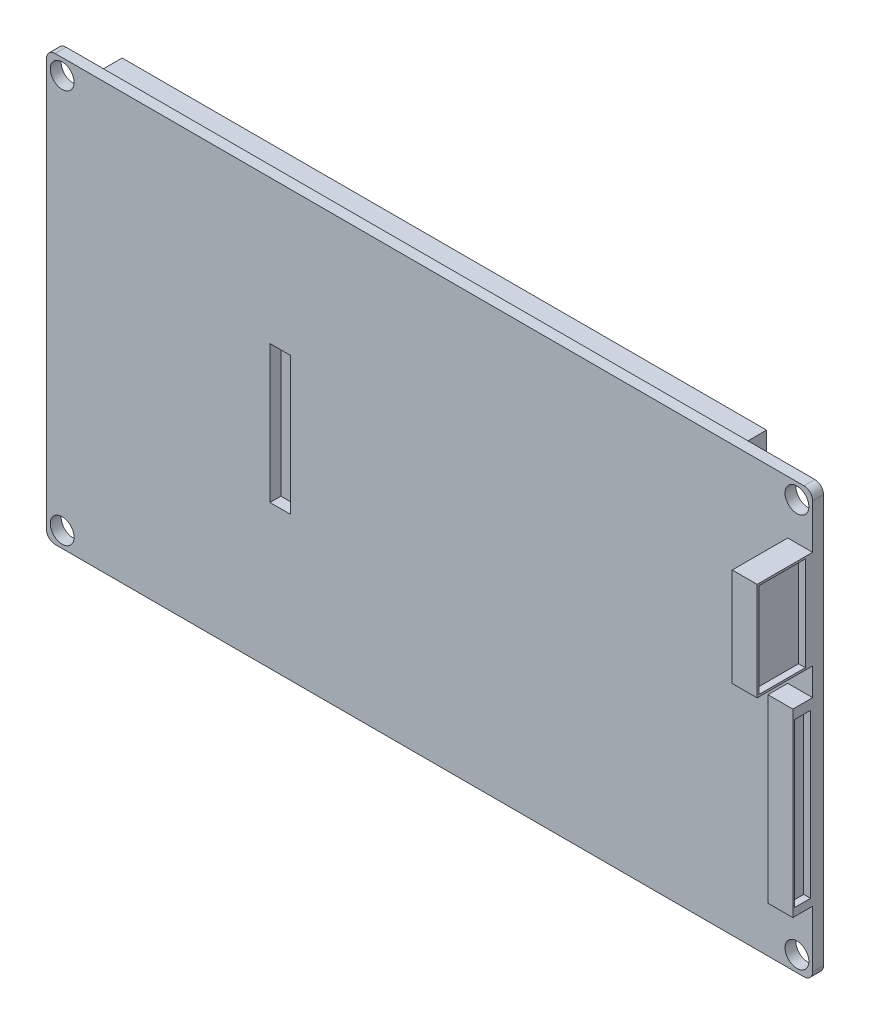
ISO-10303-21;
HEADER;
FILE_DESCRIPTION(('STEP AP214'),'2;1');
FILE_NAME('part.step','',(''),(''),'','','');
FILE_SCHEMA(('AUTOMOTIVE_DESIGN { 1 0 10303 214 1 1 1 1 }'));
ENDSEC;
DATA;
#1=APPLICATION_CONTEXT('core data for automotive mechanical design processes');
#2=APPLICATION_PROTOCOL_DEFINITION('international standard','automotive_design',2000,#1);
#3=PRODUCT_CONTEXT('',#1,'mechanical');
#4=PRODUCT('Part','Part','',(#3));
#5=PRODUCT_RELATED_PRODUCT_CATEGORY('part','',(#4));
#6=PRODUCT_DEFINITION_FORMATION('','',#4);
#7=PRODUCT_DEFINITION_CONTEXT('part definition',#1,'design');
#8=PRODUCT_DEFINITION('design','',#6,#7);
#9=PRODUCT_DEFINITION_SHAPE('','',#8);
#10=(LENGTH_UNIT() NAMED_UNIT(*) SI_UNIT(.MILLI.,.METRE.));
#11=(NAMED_UNIT(*) PLANE_ANGLE_UNIT() SI_UNIT($,.RADIAN.));
#12=(NAMED_UNIT(*) SI_UNIT($,.STERADIAN.) SOLID_ANGLE_UNIT());
#13=UNCERTAINTY_MEASURE_WITH_UNIT(LENGTH_MEASURE(1.E-05),#10,'distance_accuracy_value','');
#14=(GEOMETRIC_REPRESENTATION_CONTEXT(3) GLOBAL_UNCERTAINTY_ASSIGNED_CONTEXT((#13)) GLOBAL_UNIT_ASSIGNED_CONTEXT((#10,
#11,#12)) REPRESENTATION_CONTEXT('',''));
#15=CARTESIAN_POINT('',(0.,0.,0.));
#16=DIRECTION('',(0.,0.,1.));
#17=DIRECTION('',(1.,0.,0.));
#18=AXIS2_PLACEMENT_3D('',#15,#16,#17);
#19=CARTESIAN_POINT('',(0.,0.,1.6));
#20=DIRECTION('',(0.,0.,1.));
#21=DIRECTION('',(1.,0.,0.));
#22=AXIS2_PLACEMENT_3D('',#19,#20,#21);
#23=PLANE('',#22);
#24=CARTESIAN_POINT('',(-110.12,60.1,1.6));
#25=DIRECTION('',(0.,0.,1.));
#26=DIRECTION('',(1.,0.,0.));
#27=AXIS2_PLACEMENT_3D('',#24,#25,#26);
#28=CIRCLE('',#27,1.74999999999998);
#29=CARTESIAN_POINT('',(-108.37,60.1,1.6));
#30=VERTEX_POINT('',#29);
#31=EDGE_CURVE('E478',#30,#30,#28,.T.);
#32=ORIENTED_EDGE('',*,*,#31,.F.);
#33=EDGE_LOOP('',(#32));
#34=FACE_BOUND('',#33,.T.);
#35=CARTESIAN_POINT('',(-110.12,2.30000000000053,1.6));
#36=DIRECTION('',(0.,0.,1.));
#37=DIRECTION('',(1.,0.,0.));
#38=AXIS2_PLACEMENT_3D('',#35,#36,#37);
#39=CIRCLE('',#38,1.75000000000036);
#40=CARTESIAN_POINT('',(-108.37,2.30000000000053,1.6));
#41=VERTEX_POINT('',#40);
#42=EDGE_CURVE('E481',#41,#41,#39,.F.);
#43=ORIENTED_EDGE('',*,*,#42,.T.);
#44=EDGE_LOOP('',(#43));
#45=FACE_BOUND('',#44,.T.);
#46=CARTESIAN_POINT('',(-2.29999999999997,2.30000000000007,1.6));
#47=DIRECTION('',(0.,0.,1.));
#48=DIRECTION('',(1.,0.,0.));
#49=AXIS2_PLACEMENT_3D('',#46,#47,#48);
#50=CIRCLE('',#49,1.75000000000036);
#51=CARTESIAN_POINT('',(-0.549999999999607,2.30000000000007,1.6));
#52=VERTEX_POINT('',#51);
#53=EDGE_CURVE('E484',#52,#52,#50,.T.);
#54=ORIENTED_EDGE('',*,*,#53,.F.);
#55=EDGE_LOOP('',(#54));
#56=FACE_BOUND('',#55,.T.);
#57=CARTESIAN_POINT('',(-2.29999999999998,60.1,1.6));
#58=DIRECTION('',(0.,0.,1.));
#59=DIRECTION('',(1.,0.,0.));
#60=AXIS2_PLACEMENT_3D('',#57,#58,#59);
#61=CIRCLE('',#60,1.75000000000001);
#62=CARTESIAN_POINT('',(-0.549999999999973,60.1,1.6));
#63=VERTEX_POINT('',#62);
#64=EDGE_CURVE('E487',#63,#63,#61,.F.);
#65=ORIENTED_EDGE('',*,*,#64,.T.);
#66=EDGE_LOOP('',(#65));
#67=FACE_BOUND('',#66,.T.);
#68=DIRECTION('',(1.,0.,0.));
#69=VECTOR('',#68,1.);
#70=CARTESIAN_POINT('',(0.,41.2999999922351,1.6));
#71=LINE('',#70,#69);
#72=CARTESIAN_POINT('',(-79.6299999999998,41.2999999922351,1.6));
#73=VERTEX_POINT('',#72);
#74=CARTESIAN_POINT('',(-76.6299999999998,41.2999999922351,1.6));
#75=VERTEX_POINT('',#74);
#76=EDGE_CURVE('E490',#73,#75,#71,.T.);
#77=ORIENTED_EDGE('',*,*,#76,.T.);
#78=DIRECTION('',(0.,-1.,0.));
#79=VECTOR('',#78,1.);
#80=CARTESIAN_POINT('',(-76.6299999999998,0.,1.6));
#81=LINE('',#80,#79);
#82=CARTESIAN_POINT('',(-76.6299999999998,21.1000000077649,1.6));
#83=VERTEX_POINT('',#82);
#84=EDGE_CURVE('E493',#75,#83,#81,.T.);
#85=ORIENTED_EDGE('',*,*,#84,.T.);
#86=DIRECTION('',(1.,0.,0.));
#87=VECTOR('',#86,1.);
#88=CARTESIAN_POINT('',(0.,21.1000000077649,1.6));
#89=LINE('',#88,#87);
#90=CARTESIAN_POINT('',(-79.6299999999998,21.1000000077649,1.6));
#91=VERTEX_POINT('',#90);
#92=EDGE_CURVE('E495',#91,#83,#89,.T.);
#93=ORIENTED_EDGE('',*,*,#92,.F.);
#94=DIRECTION('',(0.,-1.,0.));
#95=VECTOR('',#94,1.);
#96=CARTESIAN_POINT('',(-79.6299999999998,0.,1.6));
#97=LINE('',#96,#95);
#98=EDGE_CURVE('E498',#73,#91,#97,.T.);
#99=ORIENTED_EDGE('',*,*,#98,.F.);
#100=EDGE_LOOP('',(#77,#85,#93,#99));
#101=FACE_BOUND('',#100,.T.);
#102=DIRECTION('',(0.,1.,0.));
#103=VECTOR('',#102,1.);
#104=CARTESIAN_POINT('',(-3.65175148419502,0.,1.6));
#105=LINE('',#104,#103);
#106=CARTESIAN_POINT('',(-3.65175148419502,9.61100000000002,1.6));
#107=VERTEX_POINT('',#106);
#108=CARTESIAN_POINT('',(-3.65175148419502,36.111,1.6));
#109=VERTEX_POINT('',#108);
#110=EDGE_CURVE('E426',#107,#109,#105,.T.);
#111=ORIENTED_EDGE('',*,*,#110,.T.);
#112=DIRECTION('',(1.,0.,0.));
#113=VECTOR('',#112,1.);
#114=CARTESIAN_POINT('',(0.,36.111,1.6));
#115=LINE('',#114,#113);
#116=CARTESIAN_POINT('',(0.,36.111,1.6));
#117=VERTEX_POINT('',#116);
#118=EDGE_CURVE('E429',#109,#117,#115,.T.);
#119=ORIENTED_EDGE('',*,*,#118,.T.);
#120=DIRECTION('',(0.,-1.,0.));
#121=VECTOR('',#120,1.);
#122=CARTESIAN_POINT('',(0.,0.,1.6));
#123=LINE('',#122,#121);
#124=CARTESIAN_POINT('',(0.,40.15,1.6));
#125=VERTEX_POINT('',#124);
#126=EDGE_CURVE('E472',#125,#117,#123,.T.);
#127=ORIENTED_EDGE('',*,*,#126,.F.);
#128=DIRECTION('',(1.,0.,0.));
#129=VECTOR('',#128,1.);
#130=CARTESIAN_POINT('',(0.,40.15,1.6));
#131=LINE('',#130,#129);
#132=CARTESIAN_POINT('',(-3.65175148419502,40.15,1.6));
#133=VERTEX_POINT('',#132);
#134=EDGE_CURVE('E453',#133,#125,#131,.T.);
#135=ORIENTED_EDGE('',*,*,#134,.F.);
#136=DIRECTION('',(0.,1.,0.));
#137=VECTOR('',#136,1.);
#138=CARTESIAN_POINT('',(-3.65175148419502,0.,1.6));
#139=LINE('',#138,#137);
#140=CARTESIAN_POINT('',(-3.65175148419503,54.58,1.6));
#141=VERTEX_POINT('',#140);
#142=EDGE_CURVE('E456',#133,#141,#139,.T.);
#143=ORIENTED_EDGE('',*,*,#142,.T.);
#144=DIRECTION('',(1.,0.,0.));
#145=VECTOR('',#144,1.);
#146=CARTESIAN_POINT('',(0.,54.58,1.6));
#147=LINE('',#146,#145);
#148=CARTESIAN_POINT('',(0.,54.58,1.6));
#149=VERTEX_POINT('',#148);
#150=EDGE_CURVE('E459',#141,#149,#147,.T.);
#151=ORIENTED_EDGE('',*,*,#150,.T.);
#152=CARTESIAN_POINT('',(0.,61.13,1.6));
#153=VERTEX_POINT('',#152);
#154=EDGE_CURVE('E468',#153,#149,#123,.T.);
#155=ORIENTED_EDGE('',*,*,#154,.F.);
#156=CARTESIAN_POINT('',(-1.27,61.13,1.6));
#157=DIRECTION('',(0.,0.,1.));
#158=DIRECTION('',(1.,0.,0.));
#159=AXIS2_PLACEMENT_3D('',#156,#157,#158);
#160=CIRCLE('',#159,1.27);
#161=CARTESIAN_POINT('',(-1.27,62.4,1.6));
#162=VERTEX_POINT('',#161);
#163=EDGE_CURVE('E564',#153,#162,#160,.T.);
#164=ORIENTED_EDGE('',*,*,#163,.T.);
#165=DIRECTION('',(1.,0.,0.));
#166=VECTOR('',#165,1.);
#167=CARTESIAN_POINT('',(0.,62.4,1.6));
#168=LINE('',#167,#166);
#169=CARTESIAN_POINT('',(-111.15,62.4,1.6));
#170=VERTEX_POINT('',#169);
#171=EDGE_CURVE('E471',#170,#162,#168,.T.);
#172=ORIENTED_EDGE('',*,*,#171,.F.);
#173=CARTESIAN_POINT('',(-111.15,61.13,1.6));
#174=DIRECTION('',(0.,0.,1.));
#175=DIRECTION('',(1.,0.,0.));
#176=AXIS2_PLACEMENT_3D('',#173,#174,#175);
#177=CIRCLE('',#176,1.27);
#178=CARTESIAN_POINT('',(-112.42,61.13,1.6));
#179=VERTEX_POINT('',#178);
#180=EDGE_CURVE('E566',#170,#179,#177,.T.);
#181=ORIENTED_EDGE('',*,*,#180,.T.);
#182=DIRECTION('',(0.,-1.,0.));
#183=VECTOR('',#182,1.);
#184=CARTESIAN_POINT('',(-112.42,0.,1.6));
#185=LINE('',#184,#183);
#186=CARTESIAN_POINT('',(-112.42,1.26999999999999,1.6));
#187=VERTEX_POINT('',#186);
#188=EDGE_CURVE('E475',#179,#187,#185,.T.);
#189=ORIENTED_EDGE('',*,*,#188,.T.);
#190=CARTESIAN_POINT('',(-111.15,1.26999999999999,1.6));
#191=DIRECTION('',(0.,0.,1.));
#192=DIRECTION('',(1.,0.,0.));
#193=AXIS2_PLACEMENT_3D('',#190,#191,#192);
#194=CIRCLE('',#193,1.27);
#195=CARTESIAN_POINT('',(-111.15,0.,1.6));
#196=VERTEX_POINT('',#195);
#197=EDGE_CURVE('E568',#187,#196,#194,.T.);
#198=ORIENTED_EDGE('',*,*,#197,.T.);
#199=DIRECTION('',(-1.,0.,0.));
#200=VECTOR('',#199,1.);
#201=CARTESIAN_POINT('',(0.,0.,1.6));
#202=LINE('',#201,#200);
#203=CARTESIAN_POINT('',(-1.27,0.,1.6));
#204=VERTEX_POINT('',#203);
#205=EDGE_CURVE('E463',#204,#196,#202,.T.);
#206=ORIENTED_EDGE('',*,*,#205,.F.);
#207=CARTESIAN_POINT('',(-1.27,1.27,1.6));
#208=DIRECTION('',(0.,0.,1.));
#209=DIRECTION('',(1.,0.,0.));
#210=AXIS2_PLACEMENT_3D('',#207,#208,#209);
#211=CIRCLE('',#210,1.27);
#212=CARTESIAN_POINT('',(0.,1.27,1.6));
#213=VERTEX_POINT('',#212);
#214=EDGE_CURVE('E561',#204,#213,#211,.T.);
#215=ORIENTED_EDGE('',*,*,#214,.T.);
#216=CARTESIAN_POINT('',(0.,9.61100000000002,1.6));
#217=VERTEX_POINT('',#216);
#218=EDGE_CURVE('E466',#217,#213,#123,.T.);
#219=ORIENTED_EDGE('',*,*,#218,.F.);
#220=DIRECTION('',(1.,0.,0.));
#221=VECTOR('',#220,1.);
#222=CARTESIAN_POINT('',(0.,9.61100000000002,1.6));
#223=LINE('',#222,#221);
#224=EDGE_CURVE('E423',#107,#217,#223,.T.);
#225=ORIENTED_EDGE('',*,*,#224,.F.);
#226=EDGE_LOOP('',(#111,#119,#127,#135,#143,#151,#155,#164,#172,#181,#189,#198,#206,#215,#219,#225));
#227=FACE_BOUND('',#226,.T.);
#228=ADVANCED_FACE('F39',(#34,#45,#56,#67,#101,#227),#23,.T.);
#229=CARTESIAN_POINT('',(0.,41.2999999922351,1.6));
#230=DIRECTION('',(0.,1.,0.));
#231=DIRECTION('',(0.,0.,1.));
#232=AXIS2_PLACEMENT_3D('',#229,#230,#231);
#233=PLANE('',#232);
#234=DIRECTION('',(1.,0.,0.));
#235=VECTOR('',#234,1.);
#236=CARTESIAN_POINT('',(0.,41.2999999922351,0.));
#237=LINE('',#236,#235);
#238=CARTESIAN_POINT('',(-79.6299999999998,41.2999999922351,0.));
#239=VERTEX_POINT('',#238);
#240=CARTESIAN_POINT('',(-76.6299999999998,41.2999999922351,0.));
#241=VERTEX_POINT('',#240);
#242=EDGE_CURVE('E524',#239,#241,#237,.T.);
#243=ORIENTED_EDGE('',*,*,#242,.T.);
#244=DIRECTION('',(0.,0.,-1.));
#245=VECTOR('',#244,1.);
#246=CARTESIAN_POINT('',(-76.6299999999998,41.2999999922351,1.6));
#247=LINE('',#246,#245);
#248=EDGE_CURVE('E541',#75,#241,#247,.T.);
#249=ORIENTED_EDGE('',*,*,#248,.F.);
#250=ORIENTED_EDGE('',*,*,#76,.F.);
#251=DIRECTION('',(0.,0.,-1.));
#252=VECTOR('',#251,1.);
#253=CARTESIAN_POINT('',(-79.6299999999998,41.2999999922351,1.6));
#254=LINE('',#253,#252);
#255=EDGE_CURVE('E501',#73,#239,#254,.T.);
#256=ORIENTED_EDGE('',*,*,#255,.T.);
#257=EDGE_LOOP('',(#243,#249,#250,#256));
#258=FACE_BOUND('',#257,.T.);
#259=ADVANCED_FACE('F656',(#258),#233,.F.);
#260=CARTESIAN_POINT('',(-76.6299999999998,0.,1.6));
#261=DIRECTION('',(1.,0.,0.));
#262=DIRECTION('',(0.,0.,-1.));
#263=AXIS2_PLACEMENT_3D('',#260,#261,#262);
#264=PLANE('',#263);
#265=DIRECTION('',(0.,-1.,0.));
#266=VECTOR('',#265,1.);
#267=CARTESIAN_POINT('',(-76.6299999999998,0.,0.));
#268=LINE('',#267,#266);
#269=CARTESIAN_POINT('',(-76.6299999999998,21.1000000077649,0.));
#270=VERTEX_POINT('',#269);
#271=EDGE_CURVE('E527',#241,#270,#268,.T.);
#272=ORIENTED_EDGE('',*,*,#271,.T.);
#273=DIRECTION('',(0.,0.,-1.));
#274=VECTOR('',#273,1.);
#275=CARTESIAN_POINT('',(-76.6299999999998,21.1000000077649,1.6));
#276=LINE('',#275,#274);
#277=EDGE_CURVE('E539',#83,#270,#276,.T.);
#278=ORIENTED_EDGE('',*,*,#277,.F.);
#279=ORIENTED_EDGE('',*,*,#84,.F.);
#280=ORIENTED_EDGE('',*,*,#248,.T.);
#281=EDGE_LOOP('',(#272,#278,#279,#280));
#282=FACE_BOUND('',#281,.T.);
#283=ADVANCED_FACE('F662',(#282),#264,.F.);
#284=CARTESIAN_POINT('',(0.,21.1000000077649,1.6));
#285=DIRECTION('',(0.,1.,0.));
#286=DIRECTION('',(0.,0.,1.));
#287=AXIS2_PLACEMENT_3D('',#284,#285,#286);
#288=PLANE('',#287);
#289=DIRECTION('',(1.,0.,0.));
#290=VECTOR('',#289,1.);
#291=CARTESIAN_POINT('',(0.,21.1000000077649,0.));
#292=LINE('',#291,#290);
#293=CARTESIAN_POINT('',(-79.6299999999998,21.1000000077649,0.));
#294=VERTEX_POINT('',#293);
#295=EDGE_CURVE('E530',#294,#270,#292,.T.);
#296=ORIENTED_EDGE('',*,*,#295,.F.);
#297=DIRECTION('',(0.,0.,-1.));
#298=VECTOR('',#297,1.);
#299=CARTESIAN_POINT('',(-79.6299999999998,21.1000000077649,1.6));
#300=LINE('',#299,#298);
#301=EDGE_CURVE('E536',#91,#294,#300,.T.);
#302=ORIENTED_EDGE('',*,*,#301,.F.);
#303=ORIENTED_EDGE('',*,*,#92,.T.);
#304=ORIENTED_EDGE('',*,*,#277,.T.);
#305=EDGE_LOOP('',(#296,#302,#303,#304));
#306=FACE_BOUND('',#305,.T.);
#307=ADVANCED_FACE('F677',(#306),#288,.T.);
#308=CARTESIAN_POINT('',(0.,0.,1.6));
#309=DIRECTION('',(0.,-1.,0.));
#310=DIRECTION('',(1.,0.,0.));
#311=AXIS2_PLACEMENT_3D('',#308,#309,#310);
#312=PLANE('',#311);
#313=ORIENTED_EDGE('',*,*,#205,.T.);
#314=DIRECTION('',(0.,0.,-1.));
#315=VECTOR('',#314,1.);
#316=CARTESIAN_POINT('',(-111.15,0.,0.));
#317=LINE('',#316,#315);
#318=CARTESIAN_POINT('',(-111.15,0.,0.));
#319=VERTEX_POINT('',#318);
#320=EDGE_CURVE('E545',#196,#319,#317,.T.);
#321=ORIENTED_EDGE('',*,*,#320,.T.);
#322=DIRECTION('',(-1.,0.,0.));
#323=VECTOR('',#322,1.);
#324=CARTESIAN_POINT('',(0.,0.,0.));
#325=LINE('',#324,#323);
#326=CARTESIAN_POINT('',(-1.27,0.,0.));
#327=VERTEX_POINT('',#326);
#328=EDGE_CURVE('E462',#327,#319,#325,.T.);
#329=ORIENTED_EDGE('',*,*,#328,.F.);
#330=DIRECTION('',(0.,0.,-1.));
#331=VECTOR('',#330,1.);
#332=CARTESIAN_POINT('',(-1.27,0.,1.6));
#333=LINE('',#332,#331);
#334=EDGE_CURVE('E543',#327,#204,#333,.F.);
#335=ORIENTED_EDGE('',*,*,#334,.T.);
#336=EDGE_LOOP('',(#313,#321,#329,#335));
#337=FACE_BOUND('',#336,.T.);
#338=ADVANCED_FACE('F590',(#337),#312,.T.);
#339=CARTESIAN_POINT('',(0.,0.,1.6));
#340=DIRECTION('',(1.,0.,0.));
#341=DIRECTION('',(0.,1.,0.));
#342=AXIS2_PLACEMENT_3D('',#339,#340,#341);
#343=PLANE('',#342);
#344=DIRECTION('',(0.,-1.,0.));
#345=VECTOR('',#344,1.);
#346=CARTESIAN_POINT('',(0.,40.45,9.44));
#347=LINE('',#346,#345);
#348=CARTESIAN_POINT('',(0.,54.28,9.44));
#349=VERTEX_POINT('',#348);
#350=CARTESIAN_POINT('',(0.,40.45,9.44));
#351=VERTEX_POINT('',#350);
#352=EDGE_CURVE('E54',#349,#351,#347,.T.);
#353=ORIENTED_EDGE('',*,*,#352,.F.);
#354=DIRECTION('',(0.,0.,1.));
#355=VECTOR('',#354,1.);
#356=CARTESIAN_POINT('',(0.,54.28,9.44));
#357=LINE('',#356,#355);
#358=CARTESIAN_POINT('',(0.,54.28,2.66));
#359=VERTEX_POINT('',#358);
#360=EDGE_CURVE('E291',#359,#349,#357,.T.);
#361=ORIENTED_EDGE('',*,*,#360,.F.);
#362=DIRECTION('',(0.,1.,0.));
#363=VECTOR('',#362,1.);
#364=CARTESIAN_POINT('',(0.,40.45,2.66));
#365=LINE('',#364,#363);
#366=CARTESIAN_POINT('',(0.,40.45,2.66));
#367=VERTEX_POINT('',#366);
#368=EDGE_CURVE('E294',#367,#359,#365,.T.);
#369=ORIENTED_EDGE('',*,*,#368,.F.);
#370=DIRECTION('',(0.,0.,-1.));
#371=VECTOR('',#370,1.);
#372=CARTESIAN_POINT('',(0.,40.45,9.44));
#373=LINE('',#372,#371);
#374=EDGE_CURVE('E300',#351,#367,#373,.T.);
#375=ORIENTED_EDGE('',*,*,#374,.F.);
#376=EDGE_LOOP('',(#353,#361,#369,#375));
#377=FACE_BOUND('',#376,.T.);
#378=DIRECTION('',(0.,-1.,0.));
#379=VECTOR('',#378,1.);
#380=CARTESIAN_POINT('',(0.,10.761,4.24));
#381=LINE('',#380,#379);
#382=CARTESIAN_POINT('',(0.,34.651,4.24));
#383=VERTEX_POINT('',#382);
#384=CARTESIAN_POINT('',(0.,10.761,4.24));
#385=VERTEX_POINT('',#384);
#386=EDGE_CURVE('E62',#383,#385,#381,.T.);
#387=ORIENTED_EDGE('',*,*,#386,.F.);
#388=DIRECTION('',(0.,0.,1.));
#389=VECTOR('',#388,1.);
#390=CARTESIAN_POINT('',(0.,34.651,4.24));
#391=LINE('',#390,#389);
#392=CARTESIAN_POINT('',(0.,34.651,1.9));
#393=VERTEX_POINT('',#392);
#394=EDGE_CURVE('E313',#393,#383,#391,.T.);
#395=ORIENTED_EDGE('',*,*,#394,.F.);
#396=DIRECTION('',(0.,1.,0.));
#397=VECTOR('',#396,1.);
#398=CARTESIAN_POINT('',(0.,10.761,1.9));
#399=LINE('',#398,#397);
#400=CARTESIAN_POINT('',(0.,10.761,1.9));
#401=VERTEX_POINT('',#400);
#402=EDGE_CURVE('E327',#401,#393,#399,.T.);
#403=ORIENTED_EDGE('',*,*,#402,.F.);
#404=DIRECTION('',(0.,0.,-1.));
#405=VECTOR('',#404,1.);
#406=CARTESIAN_POINT('',(0.,10.761,4.24));
#407=LINE('',#406,#405);
#408=EDGE_CURVE('E324',#385,#401,#407,.T.);
#409=ORIENTED_EDGE('',*,*,#408,.F.);
#410=EDGE_LOOP('',(#387,#395,#403,#409));
#411=FACE_BOUND('',#410,.T.);
#412=DIRECTION('',(0.,0.,-1.));
#413=VECTOR('',#412,1.);
#414=CARTESIAN_POINT('',(0.,1.27,1.6));
#415=LINE('',#414,#413);
#416=CARTESIAN_POINT('',(0.,1.27,0.));
#417=VERTEX_POINT('',#416);
#418=EDGE_CURVE('E47',#213,#417,#415,.T.);
#419=ORIENTED_EDGE('',*,*,#418,.T.);
#420=DIRECTION('',(0.,-1.,0.));
#421=VECTOR('',#420,1.);
#422=CARTESIAN_POINT('',(0.,0.,0.));
#423=LINE('',#422,#421);
#424=CARTESIAN_POINT('',(0.,61.13,0.));
#425=VERTEX_POINT('',#424);
#426=EDGE_CURVE('E504',#425,#417,#423,.T.);
#427=ORIENTED_EDGE('',*,*,#426,.F.);
#428=DIRECTION('',(0.,0.,-1.));
#429=VECTOR('',#428,1.);
#430=CARTESIAN_POINT('',(0.,61.13,1.6));
#431=LINE('',#430,#429);
#432=EDGE_CURVE('E11',#425,#153,#431,.F.);
#433=ORIENTED_EDGE('',*,*,#432,.T.);
#434=ORIENTED_EDGE('',*,*,#154,.T.);
#435=DIRECTION('',(0.,0.,-1.));
#436=VECTOR('',#435,1.);
#437=CARTESIAN_POINT('',(0.,54.58,9.74));
#438=LINE('',#437,#436);
#439=CARTESIAN_POINT('',(0.,54.58,9.74));
#440=VERTEX_POINT('',#439);
#441=EDGE_CURVE('E443',#440,#149,#438,.T.);
#442=ORIENTED_EDGE('',*,*,#441,.F.);
#443=DIRECTION('',(0.,-1.,0.));
#444=VECTOR('',#443,1.);
#445=CARTESIAN_POINT('',(0.,0.,9.74));
#446=LINE('',#445,#444);
#447=CARTESIAN_POINT('',(0.,40.15,9.74));
#448=VERTEX_POINT('',#447);
#449=EDGE_CURVE('E440',#440,#448,#446,.T.);
#450=ORIENTED_EDGE('',*,*,#449,.T.);
#451=DIRECTION('',(0.,0.,-1.));
#452=VECTOR('',#451,1.);
#453=CARTESIAN_POINT('',(0.,40.15,9.74));
#454=LINE('',#453,#452);
#455=EDGE_CURVE('E445',#448,#125,#454,.T.);
#456=ORIENTED_EDGE('',*,*,#455,.T.);
#457=ORIENTED_EDGE('',*,*,#126,.T.);
#458=DIRECTION('',(0.,0.,-1.));
#459=VECTOR('',#458,1.);
#460=CARTESIAN_POINT('',(0.,36.111,4.5));
#461=LINE('',#460,#459);
#462=CARTESIAN_POINT('',(0.,36.111,4.5));
#463=VERTEX_POINT('',#462);
#464=EDGE_CURVE('E413',#463,#117,#461,.T.);
#465=ORIENTED_EDGE('',*,*,#464,.F.);
#466=DIRECTION('',(0.,-1.,0.));
#467=VECTOR('',#466,1.);
#468=CARTESIAN_POINT('',(0.,0.,4.5));
#469=LINE('',#468,#467);
#470=CARTESIAN_POINT('',(0.,9.61100000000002,4.5));
#471=VERTEX_POINT('',#470);
#472=EDGE_CURVE('E410',#463,#471,#469,.T.);
#473=ORIENTED_EDGE('',*,*,#472,.T.);
#474=DIRECTION('',(0.,0.,-1.));
#475=VECTOR('',#474,1.);
#476=CARTESIAN_POINT('',(0.,9.61100000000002,4.5));
#477=LINE('',#476,#475);
#478=EDGE_CURVE('E415',#471,#217,#477,.T.);
#479=ORIENTED_EDGE('',*,*,#478,.T.);
#480=ORIENTED_EDGE('',*,*,#218,.T.);
#481=EDGE_LOOP('',(#419,#427,#433,#434,#442,#450,#456,#457,#465,#473,#479,#480));
#482=FACE_BOUND('',#481,.T.);
#483=ADVANCED_FACE('F578',(#377,#411,#482),#343,.T.);
#484=CARTESIAN_POINT('',(0.,62.4,1.6));
#485=DIRECTION('',(0.,1.,0.));
#486=DIRECTION('',(0.,0.,1.));
#487=AXIS2_PLACEMENT_3D('',#484,#485,#486);
#488=PLANE('',#487);
#489=DIRECTION('',(1.,0.,0.));
#490=VECTOR('',#489,1.);
#491=CARTESIAN_POINT('',(0.,62.4,0.));
#492=LINE('',#491,#490);
#493=CARTESIAN_POINT('',(-111.15,62.4,0.));
#494=VERTEX_POINT('',#493);
#495=CARTESIAN_POINT('',(-1.27,62.4,0.));
#496=VERTEX_POINT('',#495);
#497=EDGE_CURVE('E506',#494,#496,#492,.T.);
#498=ORIENTED_EDGE('',*,*,#497,.F.);
#499=DIRECTION('',(0.,0.,-1.));
#500=VECTOR('',#499,1.);
#501=CARTESIAN_POINT('',(-111.15,62.4,1.6));
#502=LINE('',#501,#500);
#503=EDGE_CURVE('E573',#494,#170,#502,.F.);
#504=ORIENTED_EDGE('',*,*,#503,.T.);
#505=ORIENTED_EDGE('',*,*,#171,.T.);
#506=DIRECTION('',(0.,0.,-1.));
#507=VECTOR('',#506,1.);
#508=CARTESIAN_POINT('',(-1.27,62.4,1.6));
#509=LINE('',#508,#507);
#510=EDGE_CURVE('E570',#162,#496,#509,.T.);
#511=ORIENTED_EDGE('',*,*,#510,.T.);
#512=EDGE_LOOP('',(#498,#504,#505,#511));
#513=FACE_BOUND('',#512,.T.);
#514=ADVANCED_FACE('F608',(#513),#488,.T.);
#515=CARTESIAN_POINT('',(-2.29999999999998,60.1,1.6));
#516=DIRECTION('',(0.,0.,-1.));
#517=DIRECTION('',(-1.,0.,0.));
#518=AXIS2_PLACEMENT_3D('',#515,#516,#517);
#519=CYLINDRICAL_SURFACE('',#518,1.75000000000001);
#520=ORIENTED_EDGE('',*,*,#64,.F.);
#521=EDGE_LOOP('',(#520));
#522=FACE_BOUND('',#521,.T.);
#523=CARTESIAN_POINT('',(-2.29999999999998,60.1,0.));
#524=DIRECTION('',(0.,0.,1.));
#525=DIRECTION('',(1.,0.,0.));
#526=AXIS2_PLACEMENT_3D('',#523,#524,#525);
#527=CIRCLE('',#526,1.75000000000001);
#528=CARTESIAN_POINT('',(-0.549999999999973,60.1,0.));
#529=VERTEX_POINT('',#528);
#530=EDGE_CURVE('E521',#529,#529,#527,.F.);
#531=ORIENTED_EDGE('',*,*,#530,.T.);
#532=EDGE_LOOP('',(#531));
#533=FACE_BOUND('',#532,.T.);
#534=ADVANCED_FACE('F684',(#522,#533),#519,.F.);
#535=CARTESIAN_POINT('',(-2.29999999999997,2.30000000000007,1.6));
#536=DIRECTION('',(0.,0.,-1.));
#537=DIRECTION('',(-1.,0.,0.));
#538=AXIS2_PLACEMENT_3D('',#535,#536,#537);
#539=CYLINDRICAL_SURFACE('',#538,1.75000000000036);
#540=ORIENTED_EDGE('',*,*,#53,.T.);
#541=EDGE_LOOP('',(#540));
#542=FACE_BOUND('',#541,.T.);
#543=CARTESIAN_POINT('',(-2.29999999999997,2.30000000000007,0.));
#544=DIRECTION('',(0.,0.,1.));
#545=DIRECTION('',(1.,0.,0.));
#546=AXIS2_PLACEMENT_3D('',#543,#544,#545);
#547=CIRCLE('',#546,1.75000000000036);
#548=CARTESIAN_POINT('',(-0.549999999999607,2.30000000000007,0.));
#549=VERTEX_POINT('',#548);
#550=EDGE_CURVE('E518',#549,#549,#547,.T.);
#551=ORIENTED_EDGE('',*,*,#550,.F.);
#552=EDGE_LOOP('',(#551));
#553=FACE_BOUND('',#552,.T.);
#554=ADVANCED_FACE('F687',(#542,#553),#539,.F.);
#555=CARTESIAN_POINT('',(-110.12,2.30000000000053,1.6));
#556=DIRECTION('',(0.,0.,-1.));
#557=DIRECTION('',(-1.,0.,0.));
#558=AXIS2_PLACEMENT_3D('',#555,#556,#557);
#559=CYLINDRICAL_SURFACE('',#558,1.75000000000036);
#560=ORIENTED_EDGE('',*,*,#42,.F.);
#561=EDGE_LOOP('',(#560));
#562=FACE_BOUND('',#561,.T.);
#563=CARTESIAN_POINT('',(-110.12,2.30000000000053,0.));
#564=DIRECTION('',(0.,0.,1.));
#565=DIRECTION('',(1.,0.,0.));
#566=AXIS2_PLACEMENT_3D('',#563,#564,#565);
#567=CIRCLE('',#566,1.75000000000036);
#568=CARTESIAN_POINT('',(-108.37,2.30000000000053,0.));
#569=VERTEX_POINT('',#568);
#570=EDGE_CURVE('E515',#569,#569,#567,.F.);
#571=ORIENTED_EDGE('',*,*,#570,.T.);
#572=EDGE_LOOP('',(#571));
#573=FACE_BOUND('',#572,.T.);
#574=ADVANCED_FACE('F691',(#562,#573),#559,.F.);
#575=CARTESIAN_POINT('',(-110.12,60.1,1.6));
#576=DIRECTION('',(0.,0.,-1.));
#577=DIRECTION('',(-1.,0.,0.));
#578=AXIS2_PLACEMENT_3D('',#575,#576,#577);
#579=CYLINDRICAL_SURFACE('',#578,1.74999999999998);
#580=ORIENTED_EDGE('',*,*,#31,.T.);
#581=EDGE_LOOP('',(#580));
#582=FACE_BOUND('',#581,.T.);
#583=CARTESIAN_POINT('',(-110.12,60.1,0.));
#584=DIRECTION('',(0.,0.,1.));
#585=DIRECTION('',(1.,0.,0.));
#586=AXIS2_PLACEMENT_3D('',#583,#584,#585);
#587=CIRCLE('',#586,1.74999999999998);
#588=CARTESIAN_POINT('',(-108.37,60.1,0.));
#589=VERTEX_POINT('',#588);
#590=EDGE_CURVE('E512',#589,#589,#587,.T.);
#591=ORIENTED_EDGE('',*,*,#590,.F.);
#592=EDGE_LOOP('',(#591));
#593=FACE_BOUND('',#592,.T.);
#594=ADVANCED_FACE('F695',(#582,#593),#579,.F.);
#595=CARTESIAN_POINT('',(-112.42,0.,1.6));
#596=DIRECTION('',(1.,0.,0.));
#597=DIRECTION('',(0.,1.,0.));
#598=AXIS2_PLACEMENT_3D('',#595,#596,#597);
#599=PLANE('',#598);
#600=DIRECTION('',(0.,-1.,0.));
#601=VECTOR('',#600,1.);
#602=CARTESIAN_POINT('',(-112.42,0.,0.));
#603=LINE('',#602,#601);
#604=CARTESIAN_POINT('',(-112.42,61.13,0.));
#605=VERTEX_POINT('',#604);
#606=CARTESIAN_POINT('',(-112.42,1.26999999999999,0.));
#607=VERTEX_POINT('',#606);
#608=EDGE_CURVE('E509',#605,#607,#603,.T.);
#609=ORIENTED_EDGE('',*,*,#608,.T.);
#610=DIRECTION('',(0.,0.,-1.));
#611=VECTOR('',#610,1.);
#612=CARTESIAN_POINT('',(-112.42,1.26999999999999,1.6));
#613=LINE('',#612,#611);
#614=EDGE_CURVE('E559',#607,#187,#613,.F.);
#615=ORIENTED_EDGE('',*,*,#614,.T.);
#616=ORIENTED_EDGE('',*,*,#188,.F.);
#617=DIRECTION('',(0.,0.,-1.));
#618=VECTOR('',#617,1.);
#619=CARTESIAN_POINT('',(-112.42,61.13,0.));
#620=LINE('',#619,#618);
#621=EDGE_CURVE('E556',#179,#605,#620,.T.);
#622=ORIENTED_EDGE('',*,*,#621,.T.);
#623=EDGE_LOOP('',(#609,#615,#616,#622));
#624=FACE_BOUND('',#623,.T.);
#625=ADVANCED_FACE('F599',(#624),#599,.F.);
#626=CARTESIAN_POINT('',(-79.6299999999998,0.,1.6));
#627=DIRECTION('',(1.,0.,0.));
#628=DIRECTION('',(0.,0.,-1.));
#629=AXIS2_PLACEMENT_3D('',#626,#627,#628);
#630=PLANE('',#629);
#631=DIRECTION('',(0.,-1.,0.));
#632=VECTOR('',#631,1.);
#633=CARTESIAN_POINT('',(-79.6299999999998,0.,0.));
#634=LINE('',#633,#632);
#635=EDGE_CURVE('E467',#239,#294,#634,.T.);
#636=ORIENTED_EDGE('',*,*,#635,.F.);
#637=ORIENTED_EDGE('',*,*,#255,.F.);
#638=ORIENTED_EDGE('',*,*,#98,.T.);
#639=ORIENTED_EDGE('',*,*,#301,.T.);
#640=EDGE_LOOP('',(#636,#637,#638,#639));
#641=FACE_BOUND('',#640,.T.);
#642=ADVANCED_FACE('F672',(#641),#630,.T.);
#643=CARTESIAN_POINT('',(0.,0.,0.));
#644=DIRECTION('',(0.,0.,1.));
#645=DIRECTION('',(1.,0.,0.));
#646=AXIS2_PLACEMENT_3D('',#643,#644,#645);
#647=PLANE('',#646);
#648=DIRECTION('',(0.,1.,0.));
#649=VECTOR('',#648,1.);
#650=CARTESIAN_POINT('',(-106.42,0.,0.));
#651=LINE('',#650,#649);
#652=CARTESIAN_POINT('',(-106.42,0.759999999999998,0.));
#653=VERTEX_POINT('',#652);
#654=CARTESIAN_POINT('',(-106.42,61.64,0.));
#655=VERTEX_POINT('',#654);
#656=EDGE_CURVE('E343',#653,#655,#651,.T.);
#657=ORIENTED_EDGE('',*,*,#656,.F.);
#658=DIRECTION('',(1.,0.,0.));
#659=VECTOR('',#658,1.);
#660=CARTESIAN_POINT('',(0.,0.759999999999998,0.));
#661=LINE('',#660,#659);
#662=CARTESIAN_POINT('',(-11.85,0.759999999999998,0.));
#663=VERTEX_POINT('',#662);
#664=EDGE_CURVE('E334',#653,#663,#661,.T.);
#665=ORIENTED_EDGE('',*,*,#664,.T.);
#666=DIRECTION('',(0.,1.,0.));
#667=VECTOR('',#666,1.);
#668=CARTESIAN_POINT('',(-11.85,0.,0.));
#669=LINE('',#668,#667);
#670=CARTESIAN_POINT('',(-11.85,61.64,0.));
#671=VERTEX_POINT('',#670);
#672=EDGE_CURVE('E365',#663,#671,#669,.T.);
#673=ORIENTED_EDGE('',*,*,#672,.T.);
#674=DIRECTION('',(1.,0.,0.));
#675=VECTOR('',#674,1.);
#676=CARTESIAN_POINT('',(0.,61.64,0.));
#677=LINE('',#676,#675);
#678=EDGE_CURVE('E368',#655,#671,#677,.T.);
#679=ORIENTED_EDGE('',*,*,#678,.F.);
#680=EDGE_LOOP('',(#657,#665,#673,#679));
#681=FACE_BOUND('',#680,.T.);
#682=ORIENTED_EDGE('',*,*,#426,.T.);
#683=CARTESIAN_POINT('',(-1.27,1.27,0.));
#684=DIRECTION('',(0.,0.,1.));
#685=DIRECTION('',(1.,0.,0.));
#686=AXIS2_PLACEMENT_3D('',#683,#684,#685);
#687=CIRCLE('',#686,1.27);
#688=EDGE_CURVE('E548',#417,#327,#687,.F.);
#689=ORIENTED_EDGE('',*,*,#688,.T.);
#690=ORIENTED_EDGE('',*,*,#328,.T.);
#691=CARTESIAN_POINT('',(-111.15,1.26999999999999,0.));
#692=DIRECTION('',(0.,0.,1.));
#693=DIRECTION('',(1.,0.,0.));
#694=AXIS2_PLACEMENT_3D('',#691,#692,#693);
#695=CIRCLE('',#694,1.27);
#696=EDGE_CURVE('E554',#319,#607,#695,.F.);
#697=ORIENTED_EDGE('',*,*,#696,.T.);
#698=ORIENTED_EDGE('',*,*,#608,.F.);
#699=CARTESIAN_POINT('',(-111.15,61.13,0.));
#700=DIRECTION('',(0.,0.,1.));
#701=DIRECTION('',(1.,0.,0.));
#702=AXIS2_PLACEMENT_3D('',#699,#700,#701);
#703=CIRCLE('',#702,1.27);
#704=EDGE_CURVE('E552',#605,#494,#703,.F.);
#705=ORIENTED_EDGE('',*,*,#704,.T.);
#706=ORIENTED_EDGE('',*,*,#497,.T.);
#707=CARTESIAN_POINT('',(-1.27,61.13,0.));
#708=DIRECTION('',(0.,0.,1.));
#709=DIRECTION('',(1.,0.,0.));
#710=AXIS2_PLACEMENT_3D('',#707,#708,#709);
#711=CIRCLE('',#710,1.27);
#712=EDGE_CURVE('E550',#496,#425,#711,.F.);
#713=ORIENTED_EDGE('',*,*,#712,.T.);
#714=EDGE_LOOP('',(#682,#689,#690,#697,#698,#705,#706,#713));
#715=FACE_BOUND('',#714,.T.);
#716=ORIENTED_EDGE('',*,*,#590,.T.);
#717=EDGE_LOOP('',(#716));
#718=FACE_BOUND('',#717,.T.);
#719=ORIENTED_EDGE('',*,*,#570,.F.);
#720=EDGE_LOOP('',(#719));
#721=FACE_BOUND('',#720,.T.);
#722=ORIENTED_EDGE('',*,*,#550,.T.);
#723=EDGE_LOOP('',(#722));
#724=FACE_BOUND('',#723,.T.);
#725=ORIENTED_EDGE('',*,*,#530,.F.);
#726=EDGE_LOOP('',(#725));
#727=FACE_BOUND('',#726,.T.);
#728=ADVANCED_FACE('F587',(#681,#715,#718,#721,#724,#727),#647,.F.);
#729=CARTESIAN_POINT('',(-111.15,1.26999999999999,1.6));
#730=DIRECTION('',(0.,0.,1.));
#731=DIRECTION('',(1.,0.,0.));
#732=AXIS2_PLACEMENT_3D('',#729,#730,#731);
#733=CYLINDRICAL_SURFACE('',#732,1.27);
#734=ORIENTED_EDGE('',*,*,#197,.F.);
#735=ORIENTED_EDGE('',*,*,#614,.F.);
#736=ORIENTED_EDGE('',*,*,#696,.F.);
#737=ORIENTED_EDGE('',*,*,#320,.F.);
#738=EDGE_LOOP('',(#734,#735,#736,#737));
#739=FACE_BOUND('',#738,.T.);
#740=ADVANCED_FACE('F595',(#739),#733,.T.);
#741=CARTESIAN_POINT('',(-111.15,61.13,1.6));
#742=DIRECTION('',(0.,0.,1.));
#743=DIRECTION('',(1.,0.,0.));
#744=AXIS2_PLACEMENT_3D('',#741,#742,#743);
#745=CYLINDRICAL_SURFACE('',#744,1.27);
#746=ORIENTED_EDGE('',*,*,#180,.F.);
#747=ORIENTED_EDGE('',*,*,#503,.F.);
#748=ORIENTED_EDGE('',*,*,#704,.F.);
#749=ORIENTED_EDGE('',*,*,#621,.F.);
#750=EDGE_LOOP('',(#746,#747,#748,#749));
#751=FACE_BOUND('',#750,.T.);
#752=ADVANCED_FACE('F604',(#751),#745,.T.);
#753=CARTESIAN_POINT('',(-1.27,61.13,1.6));
#754=DIRECTION('',(0.,0.,-1.));
#755=DIRECTION('',(-1.,0.,0.));
#756=AXIS2_PLACEMENT_3D('',#753,#754,#755);
#757=CYLINDRICAL_SURFACE('',#756,1.27);
#758=ORIENTED_EDGE('',*,*,#163,.F.);
#759=ORIENTED_EDGE('',*,*,#432,.F.);
#760=ORIENTED_EDGE('',*,*,#712,.F.);
#761=ORIENTED_EDGE('',*,*,#510,.F.);
#762=EDGE_LOOP('',(#758,#759,#760,#761));
#763=FACE_BOUND('',#762,.T.);
#764=ADVANCED_FACE('F613',(#763),#757,.T.);
#765=CARTESIAN_POINT('',(-1.27,1.27,1.6));
#766=DIRECTION('',(0.,0.,-1.));
#767=DIRECTION('',(-1.,0.,0.));
#768=AXIS2_PLACEMENT_3D('',#765,#766,#767);
#769=CYLINDRICAL_SURFACE('',#768,1.27);
#770=ORIENTED_EDGE('',*,*,#214,.F.);
#771=ORIENTED_EDGE('',*,*,#334,.F.);
#772=ORIENTED_EDGE('',*,*,#688,.F.);
#773=ORIENTED_EDGE('',*,*,#418,.F.);
#774=EDGE_LOOP('',(#770,#771,#772,#773));
#775=FACE_BOUND('',#774,.T.);
#776=ADVANCED_FACE('F41',(#775),#769,.T.);
#777=CARTESIAN_POINT('',(0.,54.58,9.74));
#778=DIRECTION('',(0.,-1.,0.));
#779=DIRECTION('',(0.,0.,-1.));
#780=AXIS2_PLACEMENT_3D('',#777,#778,#779);
#781=PLANE('',#780);
#782=ORIENTED_EDGE('',*,*,#150,.F.);
#783=DIRECTION('',(0.,0.,-1.));
#784=VECTOR('',#783,1.);
#785=CARTESIAN_POINT('',(-3.65175148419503,54.58,9.74));
#786=LINE('',#785,#784);
#787=CARTESIAN_POINT('',(-3.65175148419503,54.58,9.74));
#788=VERTEX_POINT('',#787);
#789=EDGE_CURVE('E450',#788,#141,#786,.T.);
#790=ORIENTED_EDGE('',*,*,#789,.F.);
#791=DIRECTION('',(-1.,0.,0.));
#792=VECTOR('',#791,1.);
#793=CARTESIAN_POINT('',(0.,54.58,9.74));
#794=LINE('',#793,#792);
#795=EDGE_CURVE('E432',#440,#788,#794,.T.);
#796=ORIENTED_EDGE('',*,*,#795,.F.);
#797=ORIENTED_EDGE('',*,*,#441,.T.);
#798=EDGE_LOOP('',(#782,#790,#796,#797));
#799=FACE_BOUND('',#798,.T.);
#800=ADVANCED_FACE('F619',(#799),#781,.F.);
#801=CARTESIAN_POINT('',(-3.65175148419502,0.,9.74));
#802=DIRECTION('',(1.,0.,0.));
#803=DIRECTION('',(0.,1.,0.));
#804=AXIS2_PLACEMENT_3D('',#801,#802,#803);
#805=PLANE('',#804);
#806=ORIENTED_EDGE('',*,*,#142,.F.);
#807=DIRECTION('',(0.,0.,-1.));
#808=VECTOR('',#807,1.);
#809=CARTESIAN_POINT('',(-3.65175148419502,40.15,9.74));
#810=LINE('',#809,#808);
#811=CARTESIAN_POINT('',(-3.65175148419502,40.15,9.74));
#812=VERTEX_POINT('',#811);
#813=EDGE_CURVE('E447',#812,#133,#810,.T.);
#814=ORIENTED_EDGE('',*,*,#813,.F.);
#815=DIRECTION('',(0.,-1.,0.));
#816=VECTOR('',#815,1.);
#817=CARTESIAN_POINT('',(-3.65175148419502,0.,9.74));
#818=LINE('',#817,#816);
#819=EDGE_CURVE('E435',#788,#812,#818,.T.);
#820=ORIENTED_EDGE('',*,*,#819,.F.);
#821=ORIENTED_EDGE('',*,*,#789,.T.);
#822=EDGE_LOOP('',(#806,#814,#820,#821));
#823=FACE_BOUND('',#822,.T.);
#824=ADVANCED_FACE('F622',(#823),#805,.F.);
#825=CARTESIAN_POINT('',(0.,40.15,9.74));
#826=DIRECTION('',(0.,-1.,0.));
#827=DIRECTION('',(0.,0.,-1.));
#828=AXIS2_PLACEMENT_3D('',#825,#826,#827);
#829=PLANE('',#828);
#830=ORIENTED_EDGE('',*,*,#813,.T.);
#831=ORIENTED_EDGE('',*,*,#134,.T.);
#832=ORIENTED_EDGE('',*,*,#455,.F.);
#833=DIRECTION('',(-1.,0.,0.));
#834=VECTOR('',#833,1.);
#835=CARTESIAN_POINT('',(0.,40.15,9.74));
#836=LINE('',#835,#834);
#837=EDGE_CURVE('E437',#448,#812,#836,.T.);
#838=ORIENTED_EDGE('',*,*,#837,.T.);
#839=EDGE_LOOP('',(#830,#831,#832,#838));
#840=FACE_BOUND('',#839,.T.);
#841=ADVANCED_FACE('F631',(#840),#829,.T.);
#842=CARTESIAN_POINT('',(0.,0.,9.74));
#843=DIRECTION('',(0.,0.,1.));
#844=DIRECTION('',(1.,0.,0.));
#845=AXIS2_PLACEMENT_3D('',#842,#843,#844);
#846=PLANE('',#845);
#847=ORIENTED_EDGE('',*,*,#795,.T.);
#848=ORIENTED_EDGE('',*,*,#819,.T.);
#849=ORIENTED_EDGE('',*,*,#837,.F.);
#850=ORIENTED_EDGE('',*,*,#449,.F.);
#851=EDGE_LOOP('',(#847,#848,#849,#850));
#852=FACE_BOUND('',#851,.T.);
#853=ADVANCED_FACE('F627',(#852),#846,.T.);
#854=CARTESIAN_POINT('',(0.,36.111,4.5));
#855=DIRECTION('',(0.,-1.,0.));
#856=DIRECTION('',(0.,0.,-1.));
#857=AXIS2_PLACEMENT_3D('',#854,#855,#856);
#858=PLANE('',#857);
#859=ORIENTED_EDGE('',*,*,#118,.F.);
#860=DIRECTION('',(0.,0.,-1.));
#861=VECTOR('',#860,1.);
#862=CARTESIAN_POINT('',(-3.65175148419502,36.111,4.5));
#863=LINE('',#862,#861);
#864=CARTESIAN_POINT('',(-3.65175148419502,36.111,4.5));
#865=VERTEX_POINT('',#864);
#866=EDGE_CURVE('E420',#865,#109,#863,.T.);
#867=ORIENTED_EDGE('',*,*,#866,.F.);
#868=DIRECTION('',(-1.,0.,0.));
#869=VECTOR('',#868,1.);
#870=CARTESIAN_POINT('',(0.,36.111,4.5));
#871=LINE('',#870,#869);
#872=EDGE_CURVE('E394',#463,#865,#871,.T.);
#873=ORIENTED_EDGE('',*,*,#872,.F.);
#874=ORIENTED_EDGE('',*,*,#464,.T.);
#875=EDGE_LOOP('',(#859,#867,#873,#874));
#876=FACE_BOUND('',#875,.T.);
#877=ADVANCED_FACE('F635',(#876),#858,.F.);
#878=CARTESIAN_POINT('',(-3.65175148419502,0.,4.5));
#879=DIRECTION('',(1.,0.,0.));
#880=DIRECTION('',(0.,1.,0.));
#881=AXIS2_PLACEMENT_3D('',#878,#879,#880);
#882=PLANE('',#881);
#883=ORIENTED_EDGE('',*,*,#110,.F.);
#884=DIRECTION('',(0.,0.,-1.));
#885=VECTOR('',#884,1.);
#886=CARTESIAN_POINT('',(-3.65175148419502,9.61100000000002,4.5));
#887=LINE('',#886,#885);
#888=CARTESIAN_POINT('',(-3.65175148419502,9.61100000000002,4.5));
#889=VERTEX_POINT('',#888);
#890=EDGE_CURVE('E417',#889,#107,#887,.T.);
#891=ORIENTED_EDGE('',*,*,#890,.F.);
#892=DIRECTION('',(0.,-1.,0.));
#893=VECTOR('',#892,1.);
#894=CARTESIAN_POINT('',(-3.65175148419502,0.,4.5));
#895=LINE('',#894,#893);
#896=EDGE_CURVE('E405',#865,#889,#895,.T.);
#897=ORIENTED_EDGE('',*,*,#896,.F.);
#898=ORIENTED_EDGE('',*,*,#866,.T.);
#899=EDGE_LOOP('',(#883,#891,#897,#898));
#900=FACE_BOUND('',#899,.T.);
#901=ADVANCED_FACE('F638',(#900),#882,.F.);
#902=CARTESIAN_POINT('',(0.,9.61100000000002,4.5));
#903=DIRECTION('',(0.,-1.,0.));
#904=DIRECTION('',(0.,0.,-1.));
#905=AXIS2_PLACEMENT_3D('',#902,#903,#904);
#906=PLANE('',#905);
#907=ORIENTED_EDGE('',*,*,#890,.T.);
#908=ORIENTED_EDGE('',*,*,#224,.T.);
#909=ORIENTED_EDGE('',*,*,#478,.F.);
#910=DIRECTION('',(-1.,0.,0.));
#911=VECTOR('',#910,1.);
#912=CARTESIAN_POINT('',(0.,9.61100000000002,4.5));
#913=LINE('',#912,#911);
#914=EDGE_CURVE('E407',#471,#889,#913,.T.);
#915=ORIENTED_EDGE('',*,*,#914,.T.);
#916=EDGE_LOOP('',(#907,#908,#909,#915));
#917=FACE_BOUND('',#916,.T.);
#918=ADVANCED_FACE('F645',(#917),#906,.T.);
#919=CARTESIAN_POINT('',(0.,0.,4.5));
#920=DIRECTION('',(0.,0.,1.));
#921=DIRECTION('',(1.,0.,0.));
#922=AXIS2_PLACEMENT_3D('',#919,#920,#921);
#923=PLANE('',#922);
#924=ORIENTED_EDGE('',*,*,#872,.T.);
#925=ORIENTED_EDGE('',*,*,#896,.T.);
#926=ORIENTED_EDGE('',*,*,#914,.F.);
#927=ORIENTED_EDGE('',*,*,#472,.F.);
#928=EDGE_LOOP('',(#924,#925,#926,#927));
#929=FACE_BOUND('',#928,.T.);
#930=ADVANCED_FACE('F643',(#929),#923,.T.);
#931=CARTESIAN_POINT('',(0.,0.,0.));
#932=DIRECTION('',(0.,0.,1.));
#933=DIRECTION('',(1.,0.,0.));
#934=AXIS2_PLACEMENT_3D('',#931,#932,#933);
#935=PLANE('',#934);
#936=ORIENTED_EDGE('',*,*,#242,.F.);
#937=ORIENTED_EDGE('',*,*,#635,.T.);
#938=ORIENTED_EDGE('',*,*,#295,.T.);
#939=ORIENTED_EDGE('',*,*,#271,.F.);
#940=EDGE_LOOP('',(#936,#937,#938,#939));
#941=FACE_BOUND('',#940,.T.);
#942=ADVANCED_FACE('F652',(#941),#935,.T.);
#943=CARTESIAN_POINT('',(0.,0.759999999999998,-3.5));
#944=DIRECTION('',(0.,-1.,0.));
#945=DIRECTION('',(0.,0.,-1.));
#946=AXIS2_PLACEMENT_3D('',#943,#944,#945);
#947=PLANE('',#946);
#948=ORIENTED_EDGE('',*,*,#664,.F.);
#949=DIRECTION('',(0.,0.,1.));
#950=VECTOR('',#949,1.);
#951=CARTESIAN_POINT('',(-106.42,0.759999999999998,-3.5));
#952=LINE('',#951,#950);
#953=CARTESIAN_POINT('',(-106.42,0.759999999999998,-3.5));
#954=VERTEX_POINT('',#953);
#955=EDGE_CURVE('E372',#954,#653,#952,.T.);
#956=ORIENTED_EDGE('',*,*,#955,.F.);
#957=DIRECTION('',(1.,0.,0.));
#958=VECTOR('',#957,1.);
#959=CARTESIAN_POINT('',(0.,0.759999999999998,-3.5));
#960=LINE('',#959,#958);
#961=CARTESIAN_POINT('',(-11.85,0.759999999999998,-3.5));
#962=VERTEX_POINT('',#961);
#963=EDGE_CURVE('E351',#954,#962,#960,.T.);
#964=ORIENTED_EDGE('',*,*,#963,.T.);
#965=DIRECTION('',(0.,0.,1.));
#966=VECTOR('',#965,1.);
#967=CARTESIAN_POINT('',(-11.85,0.759999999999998,-3.5));
#968=LINE('',#967,#966);
#969=EDGE_CURVE('E362',#962,#663,#968,.T.);
#970=ORIENTED_EDGE('',*,*,#969,.T.);
#971=EDGE_LOOP('',(#948,#956,#964,#970));
#972=FACE_BOUND('',#971,.T.);
#973=ADVANCED_FACE('F798',(#972),#947,.T.);
#974=CARTESIAN_POINT('',(-106.42,0.,-3.5));
#975=DIRECTION('',(1.,0.,0.));
#976=DIRECTION('',(0.,0.,-1.));
#977=AXIS2_PLACEMENT_3D('',#974,#975,#976);
#978=PLANE('',#977);
#979=ORIENTED_EDGE('',*,*,#656,.T.);
#980=DIRECTION('',(0.,0.,1.));
#981=VECTOR('',#980,1.);
#982=CARTESIAN_POINT('',(-106.42,61.64,-3.5));
#983=LINE('',#982,#981);
#984=CARTESIAN_POINT('',(-106.42,61.64,-3.5));
#985=VERTEX_POINT('',#984);
#986=EDGE_CURVE('E375',#985,#655,#983,.T.);
#987=ORIENTED_EDGE('',*,*,#986,.F.);
#988=DIRECTION('',(0.,1.,0.));
#989=VECTOR('',#988,1.);
#990=CARTESIAN_POINT('',(-106.42,0.,-3.5));
#991=LINE('',#990,#989);
#992=EDGE_CURVE('E359',#954,#985,#991,.T.);
#993=ORIENTED_EDGE('',*,*,#992,.F.);
#994=ORIENTED_EDGE('',*,*,#955,.T.);
#995=EDGE_LOOP('',(#979,#987,#993,#994));
#996=FACE_BOUND('',#995,.T.);
#997=ADVANCED_FACE('F817',(#996),#978,.F.);
#998=CARTESIAN_POINT('',(0.,61.64,-3.5));
#999=DIRECTION('',(0.,-1.,0.));
#1000=DIRECTION('',(1.,0.,0.));
#1001=AXIS2_PLACEMENT_3D('',#998,#999,#1000);
#1002=PLANE('',#1001);
#1003=ORIENTED_EDGE('',*,*,#678,.T.);
#1004=DIRECTION('',(0.,0.,1.));
#1005=VECTOR('',#1004,1.);
#1006=CARTESIAN_POINT('',(-11.85,61.64,-3.5));
#1007=LINE('',#1006,#1005);
#1008=CARTESIAN_POINT('',(-11.85,61.64,-3.5));
#1009=VERTEX_POINT('',#1008);
#1010=EDGE_CURVE('E377',#1009,#671,#1007,.T.);
#1011=ORIENTED_EDGE('',*,*,#1010,.F.);
#1012=DIRECTION('',(1.,0.,0.));
#1013=VECTOR('',#1012,1.);
#1014=CARTESIAN_POINT('',(0.,61.64,-3.5));
#1015=LINE('',#1014,#1013);
#1016=EDGE_CURVE('E357',#985,#1009,#1015,.T.);
#1017=ORIENTED_EDGE('',*,*,#1016,.F.);
#1018=ORIENTED_EDGE('',*,*,#986,.T.);
#1019=EDGE_LOOP('',(#1003,#1011,#1017,#1018));
#1020=FACE_BOUND('',#1019,.T.);
#1021=ADVANCED_FACE('F828',(#1020),#1002,.F.);
#1022=CARTESIAN_POINT('',(-11.85,0.,-3.5));
#1023=DIRECTION('',(1.,0.,0.));
#1024=DIRECTION('',(0.,1.,0.));
#1025=AXIS2_PLACEMENT_3D('',#1022,#1023,#1024);
#1026=PLANE('',#1025);
#1027=ORIENTED_EDGE('',*,*,#672,.F.);
#1028=ORIENTED_EDGE('',*,*,#969,.F.);
#1029=DIRECTION('',(0.,1.,0.));
#1030=VECTOR('',#1029,1.);
#1031=CARTESIAN_POINT('',(-11.85,0.,-3.5));
#1032=LINE('',#1031,#1030);
#1033=EDGE_CURVE('E354',#962,#1009,#1032,.T.);
#1034=ORIENTED_EDGE('',*,*,#1033,.T.);
#1035=ORIENTED_EDGE('',*,*,#1010,.T.);
#1036=EDGE_LOOP('',(#1027,#1028,#1034,#1035));
#1037=FACE_BOUND('',#1036,.T.);
#1038=ADVANCED_FACE('F839',(#1037),#1026,.T.);
#1039=CARTESIAN_POINT('',(0.,0.,-3.5));
#1040=DIRECTION('',(0.,0.,1.));
#1041=DIRECTION('',(1.,0.,0.));
#1042=AXIS2_PLACEMENT_3D('',#1039,#1040,#1041);
#1043=PLANE('',#1042);
#1044=DIRECTION('',(0.,1.,0.));
#1045=VECTOR('',#1044,1.);
#1046=CARTESIAN_POINT('',(-14.45,0.,-3.5));
#1047=LINE('',#1046,#1045);
#1048=CARTESIAN_POINT('',(-14.45,3.36000000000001,-3.5));
#1049=VERTEX_POINT('',#1048);
#1050=CARTESIAN_POINT('',(-14.45,59.04,-3.5));
#1051=VERTEX_POINT('',#1050);
#1052=EDGE_CURVE('E340',#1049,#1051,#1047,.T.);
#1053=ORIENTED_EDGE('',*,*,#1052,.T.);
#1054=DIRECTION('',(1.,0.,0.));
#1055=VECTOR('',#1054,1.);
#1056=CARTESIAN_POINT('',(0.,59.04,-3.5));
#1057=LINE('',#1056,#1055);
#1058=CARTESIAN_POINT('',(-97.97,59.04,-3.5));
#1059=VERTEX_POINT('',#1058);
#1060=EDGE_CURVE('E348',#1059,#1051,#1057,.T.);
#1061=ORIENTED_EDGE('',*,*,#1060,.F.);
#1062=DIRECTION('',(0.,1.,0.));
#1063=VECTOR('',#1062,1.);
#1064=CARTESIAN_POINT('',(-97.97,0.,-3.5));
#1065=LINE('',#1064,#1063);
#1066=CARTESIAN_POINT('',(-97.97,3.36000000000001,-3.5));
#1067=VERTEX_POINT('',#1066);
#1068=EDGE_CURVE('E345',#1067,#1059,#1065,.T.);
#1069=ORIENTED_EDGE('',*,*,#1068,.F.);
#1070=DIRECTION('',(1.,0.,0.));
#1071=VECTOR('',#1070,1.);
#1072=CARTESIAN_POINT('',(0.,3.36000000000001,-3.5));
#1073=LINE('',#1072,#1071);
#1074=EDGE_CURVE('E342',#1067,#1049,#1073,.T.);
#1075=ORIENTED_EDGE('',*,*,#1074,.T.);
#1076=EDGE_LOOP('',(#1053,#1061,#1069,#1075));
#1077=FACE_BOUND('',#1076,.T.);
#1078=ORIENTED_EDGE('',*,*,#963,.F.);
#1079=ORIENTED_EDGE('',*,*,#992,.T.);
#1080=ORIENTED_EDGE('',*,*,#1016,.T.);
#1081=ORIENTED_EDGE('',*,*,#1033,.F.);
#1082=EDGE_LOOP('',(#1078,#1079,#1080,#1081));
#1083=FACE_BOUND('',#1082,.T.);
#1084=ADVANCED_FACE('F787',(#1077,#1083),#1043,.F.);
#1085=CARTESIAN_POINT('',(0.,0.,-3.51));
#1086=DIRECTION('',(0.,0.,1.));
#1087=DIRECTION('',(1.,0.,0.));
#1088=AXIS2_PLACEMENT_3D('',#1085,#1086,#1087);
#1089=PLANE('',#1088);
#1090=DIRECTION('',(1.,0.,0.));
#1091=VECTOR('',#1090,1.);
#1092=CARTESIAN_POINT('',(0.,3.36000000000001,-3.51));
#1093=LINE('',#1092,#1091);
#1094=CARTESIAN_POINT('',(-97.97,3.36000000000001,-3.51));
#1095=VERTEX_POINT('',#1094);
#1096=CARTESIAN_POINT('',(-14.45,3.36000000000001,-3.51));
#1097=VERTEX_POINT('',#1096);
#1098=EDGE_CURVE('E374',#1095,#1097,#1093,.T.);
#1099=ORIENTED_EDGE('',*,*,#1098,.F.);
#1100=DIRECTION('',(0.,1.,0.));
#1101=VECTOR('',#1100,1.);
#1102=CARTESIAN_POINT('',(-97.97,0.,-3.51));
#1103=LINE('',#1102,#1101);
#1104=CARTESIAN_POINT('',(-97.97,59.04,-3.51));
#1105=VERTEX_POINT('',#1104);
#1106=EDGE_CURVE('E388',#1095,#1105,#1103,.T.);
#1107=ORIENTED_EDGE('',*,*,#1106,.T.);
#1108=DIRECTION('',(1.,0.,0.));
#1109=VECTOR('',#1108,1.);
#1110=CARTESIAN_POINT('',(0.,59.04,-3.51));
#1111=LINE('',#1110,#1109);
#1112=CARTESIAN_POINT('',(-14.45,59.04,-3.51));
#1113=VERTEX_POINT('',#1112);
#1114=EDGE_CURVE('E386',#1105,#1113,#1111,.T.);
#1115=ORIENTED_EDGE('',*,*,#1114,.T.);
#1116=DIRECTION('',(0.,1.,0.));
#1117=VECTOR('',#1116,1.);
#1118=CARTESIAN_POINT('',(-14.45,0.,-3.51));
#1119=LINE('',#1118,#1117);
#1120=EDGE_CURVE('E383',#1097,#1113,#1119,.T.);
#1121=ORIENTED_EDGE('',*,*,#1120,.F.);
#1122=EDGE_LOOP('',(#1099,#1107,#1115,#1121));
#1123=FACE_BOUND('',#1122,.T.);
#1124=ADVANCED_FACE('F782',(#1123),#1089,.F.);
#1125=CARTESIAN_POINT('',(0.,3.36000000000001,-3.51));
#1126=DIRECTION('',(0.,-1.,0.));
#1127=DIRECTION('',(1.,0.,0.));
#1128=AXIS2_PLACEMENT_3D('',#1125,#1126,#1127);
#1129=PLANE('',#1128);
#1130=DIRECTION('',(0.,0.,1.));
#1131=VECTOR('',#1130,1.);
#1132=CARTESIAN_POINT('',(-14.45,3.36000000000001,-3.51));
#1133=LINE('',#1132,#1131);
#1134=EDGE_CURVE('E390',#1097,#1049,#1133,.T.);
#1135=ORIENTED_EDGE('',*,*,#1134,.T.);
#1136=ORIENTED_EDGE('',*,*,#1074,.F.);
#1137=DIRECTION('',(0.,0.,1.));
#1138=VECTOR('',#1137,1.);
#1139=CARTESIAN_POINT('',(-97.97,3.36000000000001,-3.51));
#1140=LINE('',#1139,#1138);
#1141=EDGE_CURVE('E391',#1095,#1067,#1140,.T.);
#1142=ORIENTED_EDGE('',*,*,#1141,.F.);
#1143=ORIENTED_EDGE('',*,*,#1098,.T.);
#1144=EDGE_LOOP('',(#1135,#1136,#1142,#1143));
#1145=FACE_BOUND('',#1144,.T.);
#1146=ADVANCED_FACE('F786',(#1145),#1129,.T.);
#1147=CARTESIAN_POINT('',(-97.97,0.,-3.51));
#1148=DIRECTION('',(1.,0.,0.));
#1149=DIRECTION('',(0.,0.,-1.));
#1150=AXIS2_PLACEMENT_3D('',#1147,#1148,#1149);
#1151=PLANE('',#1150);
#1152=ORIENTED_EDGE('',*,*,#1068,.T.);
#1153=DIRECTION('',(0.,0.,1.));
#1154=VECTOR('',#1153,1.);
#1155=CARTESIAN_POINT('',(-97.97,59.04,-3.51));
#1156=LINE('',#1155,#1154);
#1157=EDGE_CURVE('E395',#1105,#1059,#1156,.T.);
#1158=ORIENTED_EDGE('',*,*,#1157,.F.);
#1159=ORIENTED_EDGE('',*,*,#1106,.F.);
#1160=ORIENTED_EDGE('',*,*,#1141,.T.);
#1161=EDGE_LOOP('',(#1152,#1158,#1159,#1160));
#1162=FACE_BOUND('',#1161,.T.);
#1163=ADVANCED_FACE('F866',(#1162),#1151,.F.);
#1164=CARTESIAN_POINT('',(0.,59.04,-3.51));
#1165=DIRECTION('',(0.,-1.,0.));
#1166=DIRECTION('',(0.,0.,-1.));
#1167=AXIS2_PLACEMENT_3D('',#1164,#1165,#1166);
#1168=PLANE('',#1167);
#1169=ORIENTED_EDGE('',*,*,#1060,.T.);
#1170=DIRECTION('',(0.,0.,1.));
#1171=VECTOR('',#1170,1.);
#1172=CARTESIAN_POINT('',(-14.45,59.04,-3.51));
#1173=LINE('',#1172,#1171);
#1174=EDGE_CURVE('E398',#1113,#1051,#1173,.T.);
#1175=ORIENTED_EDGE('',*,*,#1174,.F.);
#1176=ORIENTED_EDGE('',*,*,#1114,.F.);
#1177=ORIENTED_EDGE('',*,*,#1157,.T.);
#1178=EDGE_LOOP('',(#1169,#1175,#1176,#1177));
#1179=FACE_BOUND('',#1178,.T.);
#1180=ADVANCED_FACE('F876',(#1179),#1168,.F.);
#1181=CARTESIAN_POINT('',(-14.45,0.,-3.51));
#1182=DIRECTION('',(1.,0.,0.));
#1183=DIRECTION('',(0.,0.,-1.));
#1184=AXIS2_PLACEMENT_3D('',#1181,#1182,#1183);
#1185=PLANE('',#1184);
#1186=ORIENTED_EDGE('',*,*,#1174,.T.);
#1187=ORIENTED_EDGE('',*,*,#1052,.F.);
#1188=ORIENTED_EDGE('',*,*,#1134,.F.);
#1189=ORIENTED_EDGE('',*,*,#1120,.T.);
#1190=EDGE_LOOP('',(#1186,#1187,#1188,#1189));
#1191=FACE_BOUND('',#1190,.T.);
#1192=ADVANCED_FACE('F886',(#1191),#1185,.T.);
#1193=CARTESIAN_POINT('',(-1.,10.761,4.24));
#1194=DIRECTION('',(0.,0.,1.));
#1195=DIRECTION('',(1.,0.,0.));
#1196=AXIS2_PLACEMENT_3D('',#1193,#1194,#1195);
#1197=PLANE('',#1196);
#1198=ORIENTED_EDGE('',*,*,#386,.T.);
#1199=DIRECTION('',(1.,0.,0.));
#1200=VECTOR('',#1199,1.);
#1201=CARTESIAN_POINT('',(-1.,10.761,4.24));
#1202=LINE('',#1201,#1200);
#1203=CARTESIAN_POINT('',(-1.,10.761,4.24));
#1204=VERTEX_POINT('',#1203);
#1205=EDGE_CURVE('E322',#1204,#385,#1202,.T.);
#1206=ORIENTED_EDGE('',*,*,#1205,.F.);
#1207=DIRECTION('',(0.,-1.,0.));
#1208=VECTOR('',#1207,1.);
#1209=CARTESIAN_POINT('',(-1.,10.761,4.24));
#1210=LINE('',#1209,#1208);
#1211=CARTESIAN_POINT('',(-1.,34.651,4.24));
#1212=VERTEX_POINT('',#1211);
#1213=EDGE_CURVE('E309',#1212,#1204,#1210,.T.);
#1214=ORIENTED_EDGE('',*,*,#1213,.F.);
#1215=DIRECTION('',(1.,0.,0.));
#1216=VECTOR('',#1215,1.);
#1217=CARTESIAN_POINT('',(-1.,34.651,4.24));
#1218=LINE('',#1217,#1216);
#1219=EDGE_CURVE('E332',#1212,#383,#1218,.T.);
#1220=ORIENTED_EDGE('',*,*,#1219,.T.);
#1221=EDGE_LOOP('',(#1198,#1206,#1214,#1220));
#1222=FACE_BOUND('',#1221,.T.);
#1223=ADVANCED_FACE('F896',(#1222),#1197,.F.);
#1224=CARTESIAN_POINT('',(-1.,34.651,4.24));
#1225=DIRECTION('',(0.,1.,0.));
#1226=DIRECTION('',(0.,0.,1.));
#1227=AXIS2_PLACEMENT_3D('',#1224,#1225,#1226);
#1228=PLANE('',#1227);
#1229=ORIENTED_EDGE('',*,*,#394,.T.);
#1230=ORIENTED_EDGE('',*,*,#1219,.F.);
#1231=DIRECTION('',(0.,0.,1.));
#1232=VECTOR('',#1231,1.);
#1233=CARTESIAN_POINT('',(-1.,34.651,4.24));
#1234=LINE('',#1233,#1232);
#1235=CARTESIAN_POINT('',(-1.,34.651,1.9));
#1236=VERTEX_POINT('',#1235);
#1237=EDGE_CURVE('E319',#1236,#1212,#1234,.T.);
#1238=ORIENTED_EDGE('',*,*,#1237,.F.);
#1239=DIRECTION('',(1.,0.,0.));
#1240=VECTOR('',#1239,1.);
#1241=CARTESIAN_POINT('',(-1.,34.651,1.9));
#1242=LINE('',#1241,#1240);
#1243=EDGE_CURVE('E335',#1236,#393,#1242,.T.);
#1244=ORIENTED_EDGE('',*,*,#1243,.T.);
#1245=EDGE_LOOP('',(#1229,#1230,#1238,#1244));
#1246=FACE_BOUND('',#1245,.T.);
#1247=ADVANCED_FACE('F913',(#1246),#1228,.F.);
#1248=CARTESIAN_POINT('',(-1.,10.761,1.9));
#1249=DIRECTION('',(0.,0.,-1.));
#1250=DIRECTION('',(-1.,0.,0.));
#1251=AXIS2_PLACEMENT_3D('',#1248,#1249,#1250);
#1252=PLANE('',#1251);
#1253=ORIENTED_EDGE('',*,*,#402,.T.);
#1254=ORIENTED_EDGE('',*,*,#1243,.F.);
#1255=DIRECTION('',(0.,1.,0.));
#1256=VECTOR('',#1255,1.);
#1257=CARTESIAN_POINT('',(-1.,10.761,1.9));
#1258=LINE('',#1257,#1256);
#1259=CARTESIAN_POINT('',(-1.,10.761,1.9));
#1260=VERTEX_POINT('',#1259);
#1261=EDGE_CURVE('E316',#1260,#1236,#1258,.T.);
#1262=ORIENTED_EDGE('',*,*,#1261,.F.);
#1263=DIRECTION('',(1.,0.,0.));
#1264=VECTOR('',#1263,1.);
#1265=CARTESIAN_POINT('',(-1.,10.761,1.9));
#1266=LINE('',#1265,#1264);
#1267=EDGE_CURVE('E337',#1260,#401,#1266,.T.);
#1268=ORIENTED_EDGE('',*,*,#1267,.T.);
#1269=EDGE_LOOP('',(#1253,#1254,#1262,#1268));
#1270=FACE_BOUND('',#1269,.T.);
#1271=ADVANCED_FACE('F922',(#1270),#1252,.F.);
#1272=CARTESIAN_POINT('',(-1.,10.761,4.24));
#1273=DIRECTION('',(0.,-1.,0.));
#1274=DIRECTION('',(0.,0.,-1.));
#1275=AXIS2_PLACEMENT_3D('',#1272,#1273,#1274);
#1276=PLANE('',#1275);
#1277=ORIENTED_EDGE('',*,*,#408,.T.);
#1278=ORIENTED_EDGE('',*,*,#1267,.F.);
#1279=DIRECTION('',(0.,0.,-1.));
#1280=VECTOR('',#1279,1.);
#1281=CARTESIAN_POINT('',(-1.,10.761,4.24));
#1282=LINE('',#1281,#1280);
#1283=EDGE_CURVE('E312',#1204,#1260,#1282,.T.);
#1284=ORIENTED_EDGE('',*,*,#1283,.F.);
#1285=ORIENTED_EDGE('',*,*,#1205,.T.);
#1286=EDGE_LOOP('',(#1277,#1278,#1284,#1285));
#1287=FACE_BOUND('',#1286,.T.);
#1288=ADVANCED_FACE('F932',(#1287),#1276,.F.);
#1289=CARTESIAN_POINT('',(-1.,0.,0.));
#1290=DIRECTION('',(-1.,0.,0.));
#1291=DIRECTION('',(0.,0.,1.));
#1292=AXIS2_PLACEMENT_3D('',#1289,#1290,#1291);
#1293=PLANE('',#1292);
#1294=ORIENTED_EDGE('',*,*,#1213,.T.);
#1295=ORIENTED_EDGE('',*,*,#1283,.T.);
#1296=ORIENTED_EDGE('',*,*,#1261,.T.);
#1297=ORIENTED_EDGE('',*,*,#1237,.T.);
#1298=EDGE_LOOP('',(#1294,#1295,#1296,#1297));
#1299=FACE_BOUND('',#1298,.T.);
#1300=ADVANCED_FACE('F942',(#1299),#1293,.F.);
#1301=CARTESIAN_POINT('',(-1.,40.45,9.44));
#1302=DIRECTION('',(0.,0.,1.));
#1303=DIRECTION('',(1.,0.,0.));
#1304=AXIS2_PLACEMENT_3D('',#1301,#1302,#1303);
#1305=PLANE('',#1304);
#1306=ORIENTED_EDGE('',*,*,#352,.T.);
#1307=DIRECTION('',(1.,0.,0.));
#1308=VECTOR('',#1307,1.);
#1309=CARTESIAN_POINT('',(-1.,40.45,9.44));
#1310=LINE('',#1309,#1308);
#1311=CARTESIAN_POINT('',(-1.,40.45,9.44));
#1312=VERTEX_POINT('',#1311);
#1313=EDGE_CURVE('E269',#1312,#351,#1310,.T.);
#1314=ORIENTED_EDGE('',*,*,#1313,.F.);
#1315=DIRECTION('',(0.,-1.,0.));
#1316=VECTOR('',#1315,1.);
#1317=CARTESIAN_POINT('',(-1.,40.45,9.44));
#1318=LINE('',#1317,#1316);
#1319=CARTESIAN_POINT('',(-1.,54.28,9.44));
#1320=VERTEX_POINT('',#1319);
#1321=EDGE_CURVE('E273',#1320,#1312,#1318,.T.);
#1322=ORIENTED_EDGE('',*,*,#1321,.F.);
#1323=DIRECTION('',(1.,0.,0.));
#1324=VECTOR('',#1323,1.);
#1325=CARTESIAN_POINT('',(-1.,54.28,9.44));
#1326=LINE('',#1325,#1324);
#1327=EDGE_CURVE('E304',#1320,#349,#1326,.T.);
#1328=ORIENTED_EDGE('',*,*,#1327,.T.);
#1329=EDGE_LOOP('',(#1306,#1314,#1322,#1328));
#1330=FACE_BOUND('',#1329,.T.);
#1331=ADVANCED_FACE('F271',(#1330),#1305,.F.);
#1332=CARTESIAN_POINT('',(-1.,54.28,9.44));
#1333=DIRECTION('',(0.,1.,0.));
#1334=DIRECTION('',(0.,0.,1.));
#1335=AXIS2_PLACEMENT_3D('',#1332,#1333,#1334);
#1336=PLANE('',#1335);
#1337=ORIENTED_EDGE('',*,*,#360,.T.);
#1338=ORIENTED_EDGE('',*,*,#1327,.F.);
#1339=DIRECTION('',(0.,0.,1.));
#1340=VECTOR('',#1339,1.);
#1341=CARTESIAN_POINT('',(-1.,54.28,9.44));
#1342=LINE('',#1341,#1340);
#1343=CARTESIAN_POINT('',(-1.,54.28,2.66));
#1344=VERTEX_POINT('',#1343);
#1345=EDGE_CURVE('E279',#1344,#1320,#1342,.T.);
#1346=ORIENTED_EDGE('',*,*,#1345,.F.);
#1347=DIRECTION('',(1.,0.,0.));
#1348=VECTOR('',#1347,1.);
#1349=CARTESIAN_POINT('',(-1.,54.28,2.66));
#1350=LINE('',#1349,#1348);
#1351=EDGE_CURVE('E306',#1344,#359,#1350,.T.);
#1352=ORIENTED_EDGE('',*,*,#1351,.T.);
#1353=EDGE_LOOP('',(#1337,#1338,#1346,#1352));
#1354=FACE_BOUND('',#1353,.T.);
#1355=ADVANCED_FACE('F961',(#1354),#1336,.F.);
#1356=CARTESIAN_POINT('',(-1.,40.45,2.66));
#1357=DIRECTION('',(0.,0.,-1.));
#1358=DIRECTION('',(-1.,0.,0.));
#1359=AXIS2_PLACEMENT_3D('',#1356,#1357,#1358);
#1360=PLANE('',#1359);
#1361=ORIENTED_EDGE('',*,*,#368,.T.);
#1362=ORIENTED_EDGE('',*,*,#1351,.F.);
#1363=DIRECTION('',(0.,1.,0.));
#1364=VECTOR('',#1363,1.);
#1365=CARTESIAN_POINT('',(-1.,40.45,2.66));
#1366=LINE('',#1365,#1364);
#1367=CARTESIAN_POINT('',(-1.,40.45,2.66));
#1368=VERTEX_POINT('',#1367);
#1369=EDGE_CURVE('E287',#1368,#1344,#1366,.T.);
#1370=ORIENTED_EDGE('',*,*,#1369,.F.);
#1371=DIRECTION('',(1.,0.,0.));
#1372=VECTOR('',#1371,1.);
#1373=CARTESIAN_POINT('',(-1.,40.45,2.66));
#1374=LINE('',#1373,#1372);
#1375=EDGE_CURVE('E278',#1368,#367,#1374,.T.);
#1376=ORIENTED_EDGE('',*,*,#1375,.T.);
#1377=EDGE_LOOP('',(#1361,#1362,#1370,#1376));
#1378=FACE_BOUND('',#1377,.T.);
#1379=ADVANCED_FACE('F970',(#1378),#1360,.F.);
#1380=CARTESIAN_POINT('',(-1.,40.45,9.44));
#1381=DIRECTION('',(0.,-1.,0.));
#1382=DIRECTION('',(0.,0.,-1.));
#1383=AXIS2_PLACEMENT_3D('',#1380,#1381,#1382);
#1384=PLANE('',#1383);
#1385=ORIENTED_EDGE('',*,*,#374,.T.);
#1386=ORIENTED_EDGE('',*,*,#1375,.F.);
#1387=DIRECTION('',(0.,0.,-1.));
#1388=VECTOR('',#1387,1.);
#1389=CARTESIAN_POINT('',(-1.,40.45,9.44));
#1390=LINE('',#1389,#1388);
#1391=EDGE_CURVE('E282',#1312,#1368,#1390,.T.);
#1392=ORIENTED_EDGE('',*,*,#1391,.F.);
#1393=ORIENTED_EDGE('',*,*,#1313,.T.);
#1394=EDGE_LOOP('',(#1385,#1386,#1392,#1393));
#1395=FACE_BOUND('',#1394,.T.);
#1396=ADVANCED_FACE('F283',(#1395),#1384,.F.);
#1397=CARTESIAN_POINT('',(-1.,0.,0.));
#1398=DIRECTION('',(-1.,0.,0.));
#1399=DIRECTION('',(0.,0.,1.));
#1400=AXIS2_PLACEMENT_3D('',#1397,#1398,#1399);
#1401=PLANE('',#1400);
#1402=ORIENTED_EDGE('',*,*,#1321,.T.);
#1403=ORIENTED_EDGE('',*,*,#1391,.T.);
#1404=ORIENTED_EDGE('',*,*,#1369,.T.);
#1405=ORIENTED_EDGE('',*,*,#1345,.T.);
#1406=EDGE_LOOP('',(#1402,#1403,#1404,#1405));
#1407=FACE_BOUND('',#1406,.T.);
#1408=ADVANCED_FACE('F289',(#1407),#1401,.F.);
#1409=CLOSED_SHELL('',(#228,#259,#283,#307,#338,#483,#514,#534,#554,#574,#594,#625,#642,#728,
#740,#752,#764,#776,#800,#824,#841,#853,#877,#901,#918,#930,#942,#973,#997,#1021,#1038,#1084,
#1124,#1146,#1163,#1180,#1192,#1223,#1247,#1271,#1288,#1300,#1331,#1355,#1379,#1396,#1408));
#1410=MANIFOLD_SOLID_BREP('B2',#1409);
#1411=ADVANCED_BREP_SHAPE_REPRESENTATION('',(#18,#1410),#14);
#1412=SHAPE_DEFINITION_REPRESENTATION(#9,#1411);
ENDSEC;
END-ISO-10303-21;
